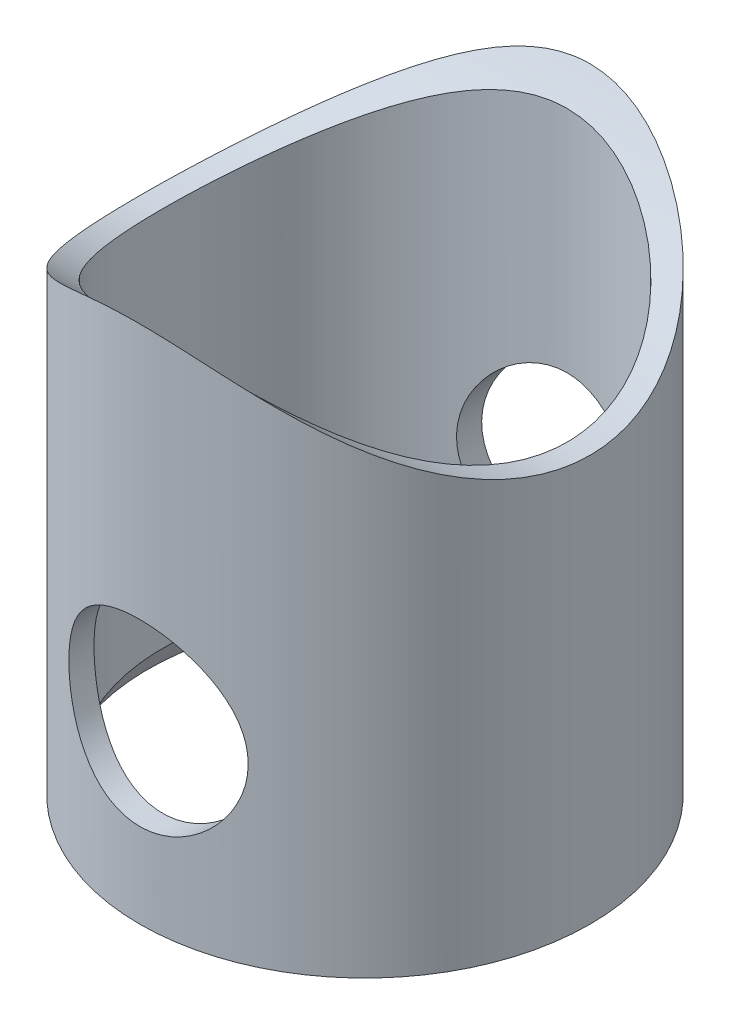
from build123d import *

# Parameters (mm, degrees)
SKIZZE1_R                            = 13.3
SKIZZE1_R_2                          = 11.95
AUFSATZ_LINEAR_AUSTRAGEN1_DEPTH      = 40
SCHNITT_LINEAR_AUSTRAGEN2_DEPTH      = 176.5107689
SCHNITT_LINEAR_AUSTRAGEN2_DEPTH_BACK = 176.5107689
FASE1_SIZE                           = 1.5
FASE1_SIZE2                          = 0.866025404
SCHNITT_LINEAR_AUSTRAGEN3_DEPTH      = 167.311170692
SCHNITT_LINEAR_AUSTRAGEN3_DEPTH_BACK = 167.311170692
SKIZZE3_R                            = 5.3


with BuildPart() as part:
    # Skizze1 → Aufsatz-Linear austragen1 (new body)
    with BuildSketch(Plane(origin=(0, 134.5, 0), x_dir=(1, 0, 0), z_dir=(0, 1, 0))):
        with Locations(Location((0, 0, 0), (0, 0, 270))):
            Circle(SKIZZE1_R)
        with Locations(Location((0, 0, 0), (0, 0, 270))):
            Circle(SKIZZE1_R_2, mode=Mode.SUBTRACT)
    extrude(amount=AUFSATZ_LINEAR_AUSTRAGEN1_DEPTH)

    # Skizze2 → Schnitt-Linear austragen2 (cut, two sides: drawn at the far end of the back side and taken through both)
    with BuildSketch(Plane(origin=(0, 0, 0), x_dir=(0, 0, -1), z_dir=(1, 0, 0)).offset(-SCHNITT_LINEAR_AUSTRAGEN2_DEPTH_BACK)):
        with BuildLine():
            Line((-15.303943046, 167.5), (-25.006884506, 167.5))
            ThreePointArc((-25.006884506, 167.5), (-32.077952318, 170.428932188), (-35.006884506, 177.5))
            Line((-35.006884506, 177.5), (-35.006884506, 197.5))
            ThreePointArc((-35.006884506, 197.5), (-32.077952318, 204.571067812), (-25.006884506, 207.5))
            Line((-25.006884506, 207.5), (24.993115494, 207.5))
            ThreePointArc((24.993115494, 207.5), (32.064183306, 204.571067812), (34.993115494, 197.5))
            Line((34.993115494, 197.5), (34.993115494, 177.5))
            ThreePointArc((34.993115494, 177.5), (32.064183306, 170.428932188), (24.993115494, 167.5))
            Line((24.993115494, 167.5), (15.290174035, 167.5))
            ThreePointArc((15.290174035, 167.5), (14.783081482, 167.361891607), (14.416056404, 166.985714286))
            ThreePointArc((14.416056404, 166.985714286), (-0.006884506, 158.5), (-14.429825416, 166.985714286))
            ThreePointArc((-14.429825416, 166.985714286), (-14.796850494, 167.361891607), (-15.303943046, 167.5))
        make_face()
    extrude(amount=SCHNITT_LINEAR_AUSTRAGEN2_DEPTH + SCHNITT_LINEAR_AUSTRAGEN2_DEPTH_BACK, mode=Mode.SUBTRACT)

    # Fase1
    fase1_edges = [part.edges().sort_by_distance(p)[0] for p in [
        (0, 134.5, -11.95),
    ]]
    fase1_side = [part.faces().sort_by_distance(p)[0] for p in [
        (0, 149.064867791, -11.95),
    ]]
    chamfer(fase1_edges, length=FASE1_SIZE, length2=FASE1_SIZE2, reference=fase1_side[0])

    # Skizze3 → Schnitt-Linear austragen3 (cut, two sides: drawn at the far end of the back side and taken through both)
    with BuildSketch(Plane.XY.offset(-SCHNITT_LINEAR_AUSTRAGEN3_DEPTH_BACK)):
        with Locations((0, 144.8)):
            Circle(SKIZZE3_R)
    extrude(amount=SCHNITT_LINEAR_AUSTRAGEN3_DEPTH + SCHNITT_LINEAR_AUSTRAGEN3_DEPTH_BACK, mode=Mode.SUBTRACT)


solid = part.part
